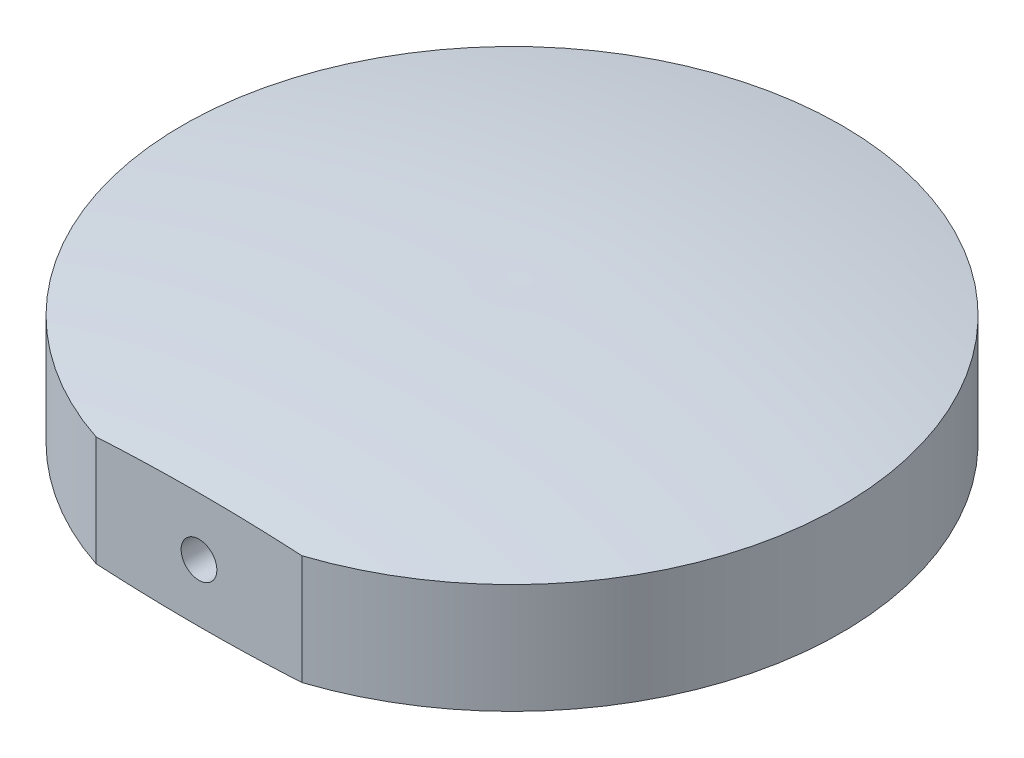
ISO-10303-21;
HEADER;
FILE_DESCRIPTION(('STEP AP214'),'2;1');
FILE_NAME('part.step','',(''),(''),'','','');
FILE_SCHEMA(('AUTOMOTIVE_DESIGN { 1 0 10303 214 1 1 1 1 }'));
ENDSEC;
DATA;
#1=APPLICATION_CONTEXT('core data for automotive mechanical design processes');
#2=APPLICATION_PROTOCOL_DEFINITION('international standard','automotive_design',2000,#1);
#3=PRODUCT_CONTEXT('',#1,'mechanical');
#4=PRODUCT('Part','Part','',(#3));
#5=PRODUCT_RELATED_PRODUCT_CATEGORY('part','',(#4));
#6=PRODUCT_DEFINITION_FORMATION('','',#4);
#7=PRODUCT_DEFINITION_CONTEXT('part definition',#1,'design');
#8=PRODUCT_DEFINITION('design','',#6,#7);
#9=PRODUCT_DEFINITION_SHAPE('','',#8);
#10=(LENGTH_UNIT() NAMED_UNIT(*) SI_UNIT(.MILLI.,.METRE.));
#11=(NAMED_UNIT(*) PLANE_ANGLE_UNIT() SI_UNIT($,.RADIAN.));
#12=(NAMED_UNIT(*) SI_UNIT($,.STERADIAN.) SOLID_ANGLE_UNIT());
#13=UNCERTAINTY_MEASURE_WITH_UNIT(LENGTH_MEASURE(1.E-05),#10,'distance_accuracy_value','');
#14=(GEOMETRIC_REPRESENTATION_CONTEXT(3) GLOBAL_UNCERTAINTY_ASSIGNED_CONTEXT((#13)) GLOBAL_UNIT_ASSIGNED_CONTEXT((#10,
#11,#12)) REPRESENTATION_CONTEXT('',''));
#15=CARTESIAN_POINT('',(0.,0.,0.));
#16=DIRECTION('',(0.,0.,1.));
#17=DIRECTION('',(1.,0.,0.));
#18=AXIS2_PLACEMENT_3D('',#15,#16,#17);
#19=CARTESIAN_POINT('',(0.,-297.99298140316,-4.12558488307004));
#20=DIRECTION('',(-1.,0.,0.));
#21=DIRECTION('',(0.,0.,-1.));
#22=AXIS2_PLACEMENT_3D('',#19,#20,#21);
#23=CIRCLE('',#22,313.020170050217);
#24=TRIMMED_CURVE('',#23,(PARAMETER_VALUE(-1.58397664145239)),
(PARAMETER_VALUE(1.58397664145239)),.T.,.PARAMETER.);
#25=CARTESIAN_POINT('',(0.,-297.99298140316,0.));
#26=DIRECTION('',(0.,-1.,0.));
#27=AXIS1_PLACEMENT('',#25,#26);
#28=SURFACE_OF_REVOLUTION('',#24,#27);
#29=CARTESIAN_POINT('',(0.,10.5291783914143,57.));
#30=CARTESIAN_POINT('',(-2.40286460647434,10.5291785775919,57.));
#31=CARTESIAN_POINT('',(-4.80574337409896,10.5031453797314,57.));
#32=CARTESIAN_POINT('',(-9.61036932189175,10.3989289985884,57.));
#33=CARTESIAN_POINT('',(-12.0121164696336,10.3207444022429,57.));
#34=CARTESIAN_POINT('',(-19.2144634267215,10.0075703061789,57.));
#35=CARTESIAN_POINT('',(-24.0120080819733,9.6939604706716,57.));
#36=CARTESIAN_POINT('',(-31.1967523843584,9.06404717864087,57.));
#37=CARTESIAN_POINT('',(-33.5912635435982,8.82729077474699,57.));
#38=CARTESIAN_POINT('',(-38.3744207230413,8.3002166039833,57.));
#39=CARTESIAN_POINT('',(-40.7630668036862,8.00989939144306,57.));
#40=CARTESIAN_POINT('',(-45.5334868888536,7.37540329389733,57.));
#41=CARTESIAN_POINT('',(-47.915260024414,7.03121787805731,57.));
#42=CARTESIAN_POINT('',(-52.6704503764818,6.28882695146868,57.));
#43=CARTESIAN_POINT('',(-55.0438672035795,5.89061895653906,57.));
#44=CARTESIAN_POINT('',(-61.7286773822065,4.69037615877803,57.));
#45=CARTESIAN_POINT('',(-66.028970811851,3.82551428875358,57.));
#46=CARTESIAN_POINT('',(-74.5897326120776,1.91613757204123,57.));
#47=CARTESIAN_POINT('',(-78.8501977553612,0.871608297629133,57.));
#48=CARTESIAN_POINT('',(-87.3246384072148,-1.39649653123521,57.));
#49=CARTESIAN_POINT('',(-91.5385993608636,-2.6201265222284,57.));
#50=CARTESIAN_POINT('',(-99.9108718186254,-5.24460526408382,57.));
#51=CARTESIAN_POINT('',(-104.069184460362,-6.64545038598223,57.));
#52=CARTESIAN_POINT('',(-112.326403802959,-9.62364947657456,57.));
#53=CARTESIAN_POINT('',(-116.425252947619,-11.2011630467,57.));
#54=CARTESIAN_POINT('',(-124.55216813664,-14.5291205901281,57.));
#55=CARTESIAN_POINT('',(-128.580233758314,-16.2795655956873,57.));
#56=CARTESIAN_POINT('',(-136.557843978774,-19.9502701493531,57.));
#57=CARTESIAN_POINT('',(-140.507394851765,-21.8705160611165,57.));
#58=CARTESIAN_POINT('',(-148.321053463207,-25.8776041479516,57.));
#59=CARTESIAN_POINT('',(-152.185161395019,-27.9644459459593,57.));
#60=CARTESIAN_POINT('',(-159.804162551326,-32.2915651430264,57.));
#61=CARTESIAN_POINT('',(-163.559459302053,-34.5311320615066,57.));
#62=CARTESIAN_POINT('',(-170.971508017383,-39.1677984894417,57.));
#63=CARTESIAN_POINT('',(-174.628260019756,-41.5648979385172,57.));
#64=CARTESIAN_POINT('',(-181.836635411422,-46.5124037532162,57.));
#65=CARTESIAN_POINT('',(-185.388256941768,-49.062812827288,57.));
#66=CARTESIAN_POINT('',(-192.379848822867,-54.3123353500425,57.));
#67=CARTESIAN_POINT('',(-195.819819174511,-57.0114487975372,57.));
#68=CARTESIAN_POINT('',(-202.581187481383,-62.5529844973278,57.));
#69=CARTESIAN_POINT('',(-205.902608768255,-65.3953782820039,57.));
#70=CARTESIAN_POINT('',(-212.421563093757,-71.2188530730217,57.));
#71=CARTESIAN_POINT('',(-215.619096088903,-74.1999341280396,57.));
#72=CARTESIAN_POINT('',(-221.884436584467,-80.2953812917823,57.));
#73=CARTESIAN_POINT('',(-224.952245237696,-83.409746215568,57.));
#74=CARTESIAN_POINT('',(-230.952593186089,-89.7661625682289,57.));
#75=CARTESIAN_POINT('',(-233.885132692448,-93.0082137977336,57.));
#76=CARTESIAN_POINT('',(-239.585812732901,-99.5866738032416,57.));
#77=CARTESIAN_POINT('',(-242.355117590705,-102.922073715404,57.));
#78=CARTESIAN_POINT('',(-247.750517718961,-109.706753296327,57.));
#79=CARTESIAN_POINT('',(-250.376613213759,-113.156032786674,57.));
#80=CARTESIAN_POINT('',(-255.48089629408,-120.162322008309,57.));
#81=CARTESIAN_POINT('',(-257.959084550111,-123.719331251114,57.));
#82=CARTESIAN_POINT('',(-262.763142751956,-130.93476620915,57.));
#83=CARTESIAN_POINT('',(-265.08901263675,-134.593191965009,57.));
#84=CARTESIAN_POINT('',(-269.584271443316,-142.004930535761,57.));
#85=CARTESIAN_POINT('',(-271.753660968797,-145.758242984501,57.));
#86=CARTESIAN_POINT('',(-275.932095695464,-153.353084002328,57.));
#87=CARTESIAN_POINT('',(-277.941140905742,-157.194612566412,57.));
#88=CARTESIAN_POINT('',(-281.79530182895,-164.95904594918,57.));
#89=CARTESIAN_POINT('',(-283.640417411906,-168.881950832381,57.));
#90=CARTESIAN_POINT('',(-287.163423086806,-176.802144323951,57.));
#91=CARTESIAN_POINT('',(-288.841313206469,-180.79943291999,57.));
#92=CARTESIAN_POINT('',(-292.025215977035,-188.857078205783,57.));
#93=CARTESIAN_POINT('',(-293.531405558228,-192.91736498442,57.));
#94=CARTESIAN_POINT('',(-296.371234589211,-201.097838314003,57.));
#95=CARTESIAN_POINT('',(-297.704874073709,-205.218024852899,57.));
#96=CARTESIAN_POINT('',(-300.197226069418,-213.510965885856,57.));
#97=CARTESIAN_POINT('',(-301.355938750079,-217.683720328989,57.));
#98=CARTESIAN_POINT('',(-303.496374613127,-226.074379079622,57.));
#99=CARTESIAN_POINT('',(-304.478097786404,-230.292283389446,57.));
#100=CARTESIAN_POINT('',(-306.26281257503,-238.76577119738,57.));
#101=CARTESIAN_POINT('',(-307.065802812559,-243.021354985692,57.));
#102=CARTESIAN_POINT('',(-308.491611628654,-251.562599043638,57.));
#103=CARTESIAN_POINT('',(-309.114430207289,-255.84825931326,57.));
#104=CARTESIAN_POINT('',(-310.178786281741,-264.442032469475,57.));
#105=CARTESIAN_POINT('',(-310.620323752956,-268.750145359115,57.));
#106=CARTESIAN_POINT('',(-311.321330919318,-277.381158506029,57.));
#107=CARTESIAN_POINT('',(-311.580800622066,-281.704058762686,57.));
#108=CARTESIAN_POINT('',(-311.917169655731,-290.355916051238,57.));
#109=CARTESIAN_POINT('',(-311.994112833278,-294.684871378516,57.));
#110=CARTESIAN_POINT('',(-311.965419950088,-303.342176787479,57.));
#111=CARTESIAN_POINT('',(-311.859783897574,-307.67052686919,57.));
#112=CARTESIAN_POINT('',(-311.466120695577,-316.318923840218,57.));
#113=CARTESIAN_POINT('',(-311.178093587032,-320.638970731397,57.));
#114=CARTESIAN_POINT('',(-310.420161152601,-329.263080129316,57.));
#115=CARTESIAN_POINT('',(-309.950255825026,-333.567142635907,57.));
#116=CARTESIAN_POINT('',(-308.829410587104,-342.151576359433,57.));
#117=CARTESIAN_POINT('',(-308.17847291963,-346.431947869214,57.));
#118=CARTESIAN_POINT('',(-306.696719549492,-354.961442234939,57.));
#119=CARTESIAN_POINT('',(-305.865903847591,-359.210565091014,57.));
#120=CARTESIAN_POINT('',(-304.025873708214,-367.67000684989,57.));
#121=CARTESIAN_POINT('',(-303.016659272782,-371.880325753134,57.));
#122=CARTESIAN_POINT('',(-300.821628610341,-380.254673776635,57.));
#123=CARTESIAN_POINT('',(-299.635812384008,-384.418702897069,57.));
#124=CARTESIAN_POINT('',(-297.089726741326,-392.692947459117,57.));
#125=CARTESIAN_POINT('',(-295.729462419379,-396.803164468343,57.));
#126=CARTESIAN_POINT('',(-292.836875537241,-404.962602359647,57.));
#127=CARTESIAN_POINT('',(-291.304552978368,-409.011823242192,57.));
#128=CARTESIAN_POINT('',(-288.070577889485,-417.042071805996,57.));
#129=CARTESIAN_POINT('',(-286.368925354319,-421.023099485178,57.));
#130=CARTESIAN_POINT('',(-282.799320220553,-428.909886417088,57.));
#131=CARTESIAN_POINT('',(-280.93136762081,-432.815645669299,57.));
#132=CARTESIAN_POINT('',(-277.032448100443,-440.545035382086,57.));
#133=CARTESIAN_POINT('',(-275.001477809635,-444.368664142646,57.));
#134=CARTESIAN_POINT('',(-270.780173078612,-451.926916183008,57.));
#135=CARTESIAN_POINT('',(-268.589838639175,-455.661539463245,57.));
#136=CARTESIAN_POINT('',(-264.053706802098,-463.035145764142,57.));
#137=CARTESIAN_POINT('',(-261.707909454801,-466.674128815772,57.));
#138=CARTESIAN_POINT('',(-256.865028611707,-473.849994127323,57.));
#139=CARTESIAN_POINT('',(-254.36794511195,-477.386876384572,57.));
#140=CARTESIAN_POINT('',(-249.226550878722,-484.352787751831,57.));
#141=CARTESIAN_POINT('',(-246.582217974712,-487.781800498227,57.));
#142=CARTESIAN_POINT('',(-241.151379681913,-494.52532849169,57.));
#143=CARTESIAN_POINT('',(-238.364874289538,-497.839843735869,57.));
#144=CARTESIAN_POINT('',(-232.654652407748,-504.348501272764,57.));
#145=CARTESIAN_POINT('',(-229.730935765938,-507.54264343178,57.));
#146=CARTESIAN_POINT('',(-223.751503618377,-513.804889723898,57.));
#147=CARTESIAN_POINT('',(-220.695788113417,-516.872993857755,57.));
#148=CARTESIAN_POINT('',(-214.457871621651,-522.877665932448,57.));
#149=CARTESIAN_POINT('',(-211.27567341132,-525.81423675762,57.));
#150=CARTESIAN_POINT('',(-204.79039935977,-531.550721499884,57.));
#151=CARTESIAN_POINT('',(-201.487323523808,-534.350635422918,57.));
#152=CARTESIAN_POINT('',(-194.766194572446,-539.808853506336,57.));
#153=CARTESIAN_POINT('',(-191.348141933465,-542.467158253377,57.));
#154=CARTESIAN_POINT('',(-184.403138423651,-547.637490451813,57.));
#155=CARTESIAN_POINT('',(-180.876187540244,-550.14951788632,57.));
#156=CARTESIAN_POINT('',(-173.717227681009,-555.024554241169,57.));
#157=CARTESIAN_POINT('',(-170.085148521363,-557.38746009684,57.));
#158=CARTESIAN_POINT('',(-162.724723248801,-561.958249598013,57.));
#159=CARTESIAN_POINT('',(-158.996377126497,-564.166133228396,57.));
#160=CARTESIAN_POINT('',(-151.450035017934,-568.423068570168,57.));
#161=CARTESIAN_POINT('',(-147.632038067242,-570.472118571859,57.));
#162=CARTESIAN_POINT('',(-139.913252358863,-574.407841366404,57.));
#163=CARTESIAN_POINT('',(-136.012463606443,-576.294514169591,57.));
#164=CARTESIAN_POINT('',(-128.135694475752,-579.902006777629,57.));
#165=CARTESIAN_POINT('',(-124.159726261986,-581.622853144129,57.));
#166=CARTESIAN_POINT('',(-116.139093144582,-584.896206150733,57.));
#167=CARTESIAN_POINT('',(-112.094428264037,-586.448712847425,57.));
#168=CARTESIAN_POINT('',(-103.943773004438,-589.382893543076,57.));
#169=CARTESIAN_POINT('',(-99.8377848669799,-590.764573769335,57.));
#170=CARTESIAN_POINT('',(-91.5716690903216,-593.355162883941,57.));
#171=CARTESIAN_POINT('',(-87.4115414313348,-594.564071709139,57.));
#172=CARTESIAN_POINT('',(-79.0323795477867,-596.81088283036,57.));
#173=CARTESIAN_POINT('',(-74.8132090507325,-597.848276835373,57.));
#174=CARTESIAN_POINT('',(-66.3354268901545,-599.746863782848,57.));
#175=CARTESIAN_POINT('',(-62.0768152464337,-600.608056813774,57.));
#176=CARTESIAN_POINT('',(-53.527582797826,-602.154099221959,57.));
#177=CARTESIAN_POINT('',(-49.2369609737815,-602.838942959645,57.));
#178=CARTESIAN_POINT('',(-40.6313722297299,-604.032965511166,57.));
#179=CARTESIAN_POINT('',(-36.3164052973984,-604.542144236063,57.));
#180=CARTESIAN_POINT('',(-27.666987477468,-605.386709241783,57.));
#181=CARTESIAN_POINT('',(-23.3325266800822,-605.721993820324,57.));
#182=CARTESIAN_POINT('',(-14.6537338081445,-606.220483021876,57.));
#183=CARTESIAN_POINT('',(-10.3094016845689,-606.383686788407,57.));
#184=CARTESIAN_POINT('',(-1.61743415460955,-606.539639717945,57.));
#185=CARTESIAN_POINT('',(2.73020143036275,-606.532378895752,57.));
#186=CARTESIAN_POINT('',(11.4218622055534,-606.347296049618,57.));
#187=CARTESIAN_POINT('',(15.7658873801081,-606.16947328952,57.));
#188=CARTESIAN_POINT('',(24.6421054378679,-605.629454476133,57.));
#189=CARTESIAN_POINT('',(29.1738114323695,-605.259192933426,57.));
#190=CARTESIAN_POINT('',(38.2176101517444,-604.327796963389,57.));
#191=CARTESIAN_POINT('',(42.7297028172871,-603.76666195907,57.));
#192=CARTESIAN_POINT('',(51.72552600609,-602.451838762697,57.));
#193=CARTESIAN_POINT('',(56.2092580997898,-601.698161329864,57.));
#194=CARTESIAN_POINT('',(65.1399613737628,-599.997634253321,57.));
#195=CARTESIAN_POINT('',(69.5869325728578,-599.050784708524,57.));
#196=CARTESIAN_POINT('',(78.4326388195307,-596.964993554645,57.));
#197=CARTESIAN_POINT('',(82.8314026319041,-595.826173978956,57.));
#198=CARTESIAN_POINT('',(91.5749480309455,-593.35728165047,57.));
#199=CARTESIAN_POINT('',(95.9197295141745,-592.027208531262,57.));
#200=CARTESIAN_POINT('',(104.546919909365,-589.177705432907,57.));
#201=CARTESIAN_POINT('',(108.829326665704,-587.658268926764,57.));
#202=CARTESIAN_POINT('',(117.323191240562,-584.432595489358,57.));
#203=CARTESIAN_POINT('',(121.534649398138,-582.726359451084,57.));
#204=CARTESIAN_POINT('',(129.777179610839,-579.173712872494,57.));
#205=CARTESIAN_POINT('',(133.810149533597,-577.331703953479,57.));
#206=CARTESIAN_POINT('',(141.793120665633,-573.475931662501,57.));
#207=CARTESIAN_POINT('',(145.743122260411,-571.462169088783,57.));
#208=CARTESIAN_POINT('',(153.55267955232,-567.266533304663,57.));
#209=CARTESIAN_POINT('',(157.412237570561,-565.084664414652,57.));
#210=CARTESIAN_POINT('',(165.033803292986,-560.556714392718,57.));
#211=CARTESIAN_POINT('',(168.795810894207,-558.210633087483,57.));
#212=CARTESIAN_POINT('',(176.216332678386,-553.357826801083,57.));
#213=CARTESIAN_POINT('',(179.87481602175,-550.851054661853,57.));
#214=CARTESIAN_POINT('',(187.080295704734,-545.682090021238,57.));
#215=CARTESIAN_POINT('',(190.627291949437,-543.019897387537,57.));
#216=CARTESIAN_POINT('',(197.603144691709,-537.545018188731,57.));
#217=CARTESIAN_POINT('',(201.032001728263,-534.732332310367,57.));
#218=CARTESIAN_POINT('',(207.765175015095,-528.961664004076,57.));
#219=CARTESIAN_POINT('',(211.069491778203,-526.003682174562,57.));
#220=CARTESIAN_POINT('',(217.4779881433,-520.012806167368,57.));
#221=CARTESIAN_POINT('',(220.584939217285,-516.98287587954,57.));
#222=CARTESIAN_POINT('',(226.668109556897,-510.794520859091,57.));
#223=CARTESIAN_POINT('',(229.644329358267,-507.636096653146,57.));
#224=CARTESIAN_POINT('',(235.460669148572,-501.19642231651,57.));
#225=CARTESIAN_POINT('',(238.300791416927,-497.915174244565,57.));
#226=CARTESIAN_POINT('',(243.839911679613,-491.235641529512,57.));
#227=CARTESIAN_POINT('',(246.538909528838,-487.83735676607,57.));
#228=CARTESIAN_POINT('',(251.790490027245,-480.930412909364,57.));
#229=CARTESIAN_POINT('',(254.343098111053,-477.421773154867,57.));
#230=CARTESIAN_POINT('',(259.297841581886,-470.299810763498,57.));
#231=CARTESIAN_POINT('',(261.699977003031,-466.686488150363,57.));
#232=CARTESIAN_POINT('',(266.349487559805,-459.361589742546,57.));
#233=CARTESIAN_POINT('',(268.596862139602,-455.650013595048,57.));
#234=CARTESIAN_POINT('',(272.932821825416,-448.135241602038,57.));
#235=CARTESIAN_POINT('',(275.021406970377,-444.332045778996,57.));
#236=CARTESIAN_POINT('',(279.032527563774,-436.647573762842,57.));
#237=CARTESIAN_POINT('',(280.955348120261,-432.766446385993,57.));
#238=CARTESIAN_POINT('',(284.635608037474,-424.926558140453,57.));
#239=CARTESIAN_POINT('',(286.393047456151,-420.967797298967,57.));
#240=CARTESIAN_POINT('',(289.739410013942,-412.979691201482,57.));
#241=CARTESIAN_POINT('',(291.328333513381,-408.95034609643,57.));
#242=CARTESIAN_POINT('',(294.334837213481,-400.828230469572,57.));
#243=CARTESIAN_POINT('',(295.752417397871,-396.735459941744,57.));
#244=CARTESIAN_POINT('',(298.413765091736,-388.493598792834,57.));
#245=CARTESIAN_POINT('',(299.657525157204,-384.344505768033,57.));
#246=CARTESIAN_POINT('',(301.968944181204,-375.997554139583,57.));
#247=CARTESIAN_POINT('',(303.03660313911,-371.79969553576,57.));
#248=CARTESIAN_POINT('',(304.993917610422,-363.362681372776,57.));
#249=CARTESIAN_POINT('',(305.88357305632,-359.123525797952,57.));
#250=CARTESIAN_POINT('',(307.483294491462,-350.611463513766,57.));
#251=CARTESIAN_POINT('',(308.193360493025,-346.338556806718,57.));
#252=CARTESIAN_POINT('',(309.43239645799,-337.768265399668,57.));
#253=CARTESIAN_POINT('',(309.961436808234,-333.470890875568,57.));
#254=CARTESIAN_POINT('',(310.837861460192,-324.857657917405,57.));
#255=CARTESIAN_POINT('',(311.185245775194,-320.541799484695,57.));
#256=CARTESIAN_POINT('',(311.697739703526,-311.899275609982,57.));
#257=CARTESIAN_POINT('',(311.862849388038,-307.5726101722,57.));
#258=CARTESIAN_POINT('',(312.010500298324,-298.916165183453,57.));
#259=CARTESIAN_POINT('',(311.993041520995,-294.586385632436,57.));
#260=CARTESIAN_POINT('',(311.775587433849,-285.931446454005,57.));
#261=CARTESIAN_POINT('',(311.575593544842,-281.606286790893,57.));
#262=CARTESIAN_POINT('',(310.993427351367,-272.968245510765,57.));
#263=CARTESIAN_POINT('',(310.611255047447,-268.655363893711,57.));
#264=CARTESIAN_POINT('',(309.665412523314,-260.049548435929,57.));
#265=CARTESIAN_POINT('',(309.101742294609,-255.756614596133,57.));
#266=CARTESIAN_POINT('',(307.793907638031,-247.198329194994,57.));
#267=CARTESIAN_POINT('',(307.049743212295,-242.932977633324,57.));
#268=CARTESIAN_POINT('',(305.382305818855,-234.437750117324,57.));
#269=CARTESIAN_POINT('',(304.459045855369,-230.207871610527,57.));
#270=CARTESIAN_POINT('',(302.435026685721,-221.790797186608,57.));
#271=CARTESIAN_POINT('',(301.334267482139,-217.603601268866,57.));
#272=CARTESIAN_POINT('',(298.9572097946,-209.279336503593,57.));
#273=CARTESIAN_POINT('',(297.680911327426,-205.142267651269,57.));
#274=CARTESIAN_POINT('',(294.955047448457,-196.925611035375,57.));
#275=CARTESIAN_POINT('',(293.505482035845,-192.846023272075,57.));
#276=CARTESIAN_POINT('',(290.435665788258,-184.751581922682,57.));
#277=CARTESIAN_POINT('',(288.815415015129,-180.736728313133,57.));
#278=CARTESIAN_POINT('',(285.407112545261,-172.778889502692,57.));
#279=CARTESIAN_POINT('',(283.61906084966,-168.835904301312,57.));
#280=CARTESIAN_POINT('',(279.878340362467,-161.028809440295,57.));
#281=CARTESIAN_POINT('',(277.925671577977,-157.164699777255,57.));
#282=CARTESIAN_POINT('',(273.859193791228,-149.522221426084,57.));
#283=CARTESIAN_POINT('',(271.745384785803,-145.743852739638,57.));
#284=CARTESIAN_POINT('',(267.360149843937,-138.279158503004,57.));
#285=CARTESIAN_POINT('',(265.08870663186,-134.592843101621,57.));
#286=CARTESIAN_POINT('',(260.392455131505,-127.319233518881,57.));
#287=CARTESIAN_POINT('',(257.96764684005,-123.731939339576,57.));
#288=CARTESIAN_POINT('',(252.968983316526,-116.662740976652,57.));
#289=CARTESIAN_POINT('',(250.395128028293,-113.180836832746,57.));
#290=CARTESIAN_POINT('',(245.102956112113,-106.328600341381,57.));
#291=CARTESIAN_POINT('',(242.384639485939,-102.958267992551,57.));
#292=CARTESIAN_POINT('',(236.808514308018,-96.3353051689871,57.));
#293=CARTESIAN_POINT('',(233.950712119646,-93.0826693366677,57.));
#294=CARTESIAN_POINT('',(228.100592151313,-86.7007038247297,57.));
#295=CARTESIAN_POINT('',(225.108274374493,-83.5713741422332,57.));
#296=CARTESIAN_POINT('',(218.994460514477,-77.4415699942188,57.));
#297=CARTESIAN_POINT('',(215.872964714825,-74.4410952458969,57.));
#298=CARTESIAN_POINT('',(209.506349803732,-68.5743015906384,57.));
#299=CARTESIAN_POINT('',(206.261230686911,-65.7079826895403,57.));
#300=CARTESIAN_POINT('',(199.652349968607,-60.113885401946,57.));
#301=CARTESIAN_POINT('',(196.288559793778,-57.3861407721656,57.));
#302=CARTESIAN_POINT('',(189.449078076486,-52.0747479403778,57.));
#303=CARTESIAN_POINT('',(185.973386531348,-49.4910997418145,57.));
#304=CARTESIAN_POINT('',(178.916271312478,-44.4724225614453,57.));
#305=CARTESIAN_POINT('',(175.334846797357,-42.0373947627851,57.));
#306=CARTESIAN_POINT('',(168.072679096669,-37.3202446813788,57.));
#307=CARTESIAN_POINT('',(164.391935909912,-35.0381224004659,57.));
#308=CARTESIAN_POINT('',(156.936409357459,-30.6299950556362,57.));
#309=CARTESIAN_POINT('',(153.161593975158,-28.5040441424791,57.));
#310=CARTESIAN_POINT('',(145.525884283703,-24.4127991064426,57.));
#311=CARTESIAN_POINT('',(141.664989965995,-22.4475049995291,57.));
#312=CARTESIAN_POINT('',(133.864151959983,-18.6809871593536,57.));
#313=CARTESIAN_POINT('',(129.924211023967,-16.8797577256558,57.));
#314=CARTESIAN_POINT('',(121.972188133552,-13.4442975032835,57.));
#315=CARTESIAN_POINT('',(117.960106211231,-11.810066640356,57.));
#316=CARTESIAN_POINT('',(109.86085720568,-8.7073633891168,57.));
#317=CARTESIAN_POINT('',(105.773527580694,-7.23931530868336,57.));
#318=CARTESIAN_POINT('',(97.5408877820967,-4.47593259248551,57.));
#319=CARTESIAN_POINT('',(93.3955774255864,-3.18059850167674,57.));
#320=CARTESIAN_POINT('',(85.053895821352,-0.764263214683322,57.));
#321=CARTESIAN_POINT('',(80.8575181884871,0.356715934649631,57.));
#322=CARTESIAN_POINT('',(72.4217777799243,2.42291990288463,57.));
#323=CARTESIAN_POINT('',(68.182415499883,3.36814674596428,57.));
#324=CARTESIAN_POINT('',(59.6764836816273,5.08065813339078,57.));
#325=CARTESIAN_POINT('',(55.4099828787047,5.84828432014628,57.));
#326=CARTESIAN_POINT('',(46.8489787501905,7.20824274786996,57.));
#327=CARTESIAN_POINT('',(42.554474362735,7.80056830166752,57.));
#328=CARTESIAN_POINT('',(33.9474169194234,8.81080170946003,57.));
#329=CARTESIAN_POINT('',(29.6348747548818,9.22880275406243,57.));
#330=CARTESIAN_POINT('',(20.996670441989,9.89281858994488,57.));
#331=CARTESIAN_POINT('',(16.6710090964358,10.1388436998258,57.));
#332=CARTESIAN_POINT('',(11.3142829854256,10.3381275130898,57.));
#333=CARTESIAN_POINT('',(10.2858461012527,10.3715852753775,57.));
#334=CARTESIAN_POINT('',(8.22879169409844,10.4289221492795,57.));
#335=CARTESIAN_POINT('',(7.20017419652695,10.4528021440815,57.));
#336=CARTESIAN_POINT('',(4.11455977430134,10.5100944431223,57.));
#337=CARTESIAN_POINT('',(2.05728507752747,10.5291782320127,57.));
#338=CARTESIAN_POINT('',(0.,10.5291783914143,57.));
#339=B_SPLINE_CURVE_WITH_KNOTS('',3,(#29,#30,#31,#32,#33,#34,#35,#36,#37,#38,#39,#40,#41,#42,
#43,#44,#45,#46,#47,#48,#49,#50,#51,#52,#53,#54,#55,#56,#57,#58,#59,#60,#61,#62,#63,#64,#65,#66,
#67,#68,#69,#70,#71,#72,#73,#74,#75,#76,#77,#78,#79,#80,#81,#82,#83,#84,#85,#86,#87,#88,#89,#90,
#91,#92,#93,#94,#95,#96,#97,#98,#99,#100,#101,#102,#103,#104,#105,#106,#107,#108,#109,#110,#111,
#112,#113,#114,#115,#116,#117,#118,#119,#120,#121,#122,#123,#124,#125,#126,#127,#128,#129,#130,
#131,#132,#133,#134,#135,#136,#137,#138,#139,#140,#141,#142,#143,#144,#145,#146,#147,#148,#149,
#150,#151,#152,#153,#154,#155,#156,#157,#158,#159,#160,#161,#162,#163,#164,#165,#166,#167,#168,
#169,#170,#171,#172,#173,#174,#175,#176,#177,#178,#179,#180,#181,#182,#183,#184,#185,#186,#187,
#188,#189,#190,#191,#192,#193,#194,#195,#196,#197,#198,#199,#200,#201,#202,#203,#204,#205,#206,
#207,#208,#209,#210,#211,#212,#213,#214,#215,#216,#217,#218,#219,#220,#221,#222,#223,#224,#225,
#226,#227,#228,#229,#230,#231,#232,#233,#234,#235,#236,#237,#238,#239,#240,#241,#242,#243,#244,
#245,#246,#247,#248,#249,#250,#251,#252,#253,#254,#255,#256,#257,#258,#259,#260,#261,#262,#263,
#264,#265,#266,#267,#268,#269,#270,#271,#272,#273,#274,#275,#276,#277,#278,#279,#280,#281,#282,
#283,#284,#285,#286,#287,#288,#289,#290,#291,#292,#293,#294,#295,#296,#297,#298,#299,#300,#301,
#302,#303,#304,#305,#306,#307,#308,#309,#310,#311,#312,#313,#314,#315,#316,#317,#318,#319,#320,
#321,#322,#323,#324,#325,#326,#327,#328,#329,#330,#331,#332,#333,#334,#335,#336,#337,#338),
.UNSPECIFIED.,.T.,.F.,(4,2,2,2,2,2,2,2,2,2,2,2,2,2,2,2,2,2,2,2,2,2,2,2,2,2,2,2,2,2,2,2,2,2,2,2,
2,2,2,2,2,2,2,2,2,2,2,2,2,2,2,2,2,2,2,2,2,2,2,2,2,2,2,2,2,2,2,2,2,2,2,2,2,2,2,2,2,2,2,2,2,2,2,2,
2,2,2,2,2,2,2,2,2,2,2,2,2,2,2,2,2,2,2,2,2,2,2,2,2,2,2,2,2,2,2,2,2,2,2,2,2,2,2,2,2,2,2,2,2,2,2,2,
2,2,2,2,2,2,2,2,2,2,2,2,2,2,2,2,2,2,2,2,2,2,4),(0.,7.20844734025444,14.4170900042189,
28.8348569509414,36.052963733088,43.2709958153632,50.4899036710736,57.7091435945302,
70.8642041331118,84.0203215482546,97.1804460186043,110.340301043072,123.512142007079,
136.684061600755,149.854924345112,163.025757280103,176.139024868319,189.252287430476,
202.365781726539,215.479275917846,228.590174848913,241.701078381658,254.811865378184,
267.922631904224,280.924371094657,293.926089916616,306.927749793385,319.929414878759,
332.931029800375,345.932643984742,358.934268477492,371.935890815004,384.923992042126,
397.912090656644,410.900176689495,423.888263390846,436.876450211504,449.864637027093,
462.852825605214,475.841013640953,488.826081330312,501.811148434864,514.796212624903,
527.781276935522,540.76618037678,553.751083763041,566.735987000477,579.720890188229,
592.705414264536,605.689938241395,618.67446261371,631.658987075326,644.643780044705,
657.628572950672,670.613361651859,683.598150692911,696.584900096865,709.57164982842,
722.558413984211,735.545178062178,748.531657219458,761.518135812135,774.504560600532,
787.490986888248,800.48629254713,813.481599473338,826.477046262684,839.472492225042,
852.465853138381,865.459209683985,878.452092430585,891.44497992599,904.475707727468,
917.506428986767,930.537566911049,943.568711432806,956.607468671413,969.646290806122,
982.685876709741,995.725518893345,1009.36192681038,1022.99837594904,1036.63406325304,
1050.26974357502,1063.89678829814,1077.52385912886,1091.15139978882,1104.77887530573,
1118.0759446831,1131.37295226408,1144.66961822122,1157.96629821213,1171.2668984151,
1184.56750994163,1197.86806077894,1211.16855684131,1224.18401798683,1237.19942578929,
1250.2146155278,1263.22981864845,1276.24275353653,1289.25568547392,1302.26866414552,
1315.28163962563,1328.27176718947,1341.26189020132,1354.25198543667,1367.24208190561,
1380.2327345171,1393.22338717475,1406.21404475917,1419.20470145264,1432.19030133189,
1445.17590026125,1458.16149411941,1471.14708819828,1484.13258120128,1497.11807416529,
1510.10356773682,1523.08906115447,1536.07361204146,1549.0581627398,1562.04271219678,
1575.02726171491,1588.01180652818,1600.99635125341,1613.98089541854,1626.9654398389,
1639.95140953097,1652.93737949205,1665.92335434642,1678.90932904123,1691.89471186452,
1704.88009438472,1717.86544840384,1730.85080298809,1743.83930578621,1756.82780889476,
1769.81641538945,1782.80502203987,1795.79811129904,1808.79120184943,1821.78384078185,
1834.77647393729,1847.80156609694,1860.82669935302,1873.85347827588,1886.88010715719,
1899.88146499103,1912.88331872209,1925.87821296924,1938.87232745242,1941.9592512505,
1945.04589033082,1951.21762015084),.UNSPECIFIED.);
#340=CARTESIAN_POINT('',(18.7349939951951,10.,57.));
#341=VERTEX_POINT('',#340);
#342=CARTESIAN_POINT('',(-18.7349939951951,10.,57.));
#343=VERTEX_POINT('',#342);
#344=EDGE_CURVE('E73',#341,#343,#339,.T.);
#345=ORIENTED_EDGE('',*,*,#344,.F.);
#346=CARTESIAN_POINT('',(0.,10.,0.));
#347=DIRECTION('',(0.,-1.,0.));
#348=DIRECTION('',(0.,0.,-1.));
#349=AXIS2_PLACEMENT_3D('',#346,#347,#348);
#350=CIRCLE('',#349,60.);
#351=EDGE_CURVE('E11',#343,#341,#350,.T.);
#352=ORIENTED_EDGE('',*,*,#351,.F.);
#353=EDGE_LOOP('',(#345,#352));
#354=FACE_BOUND('',#353,.T.);
#355=CARTESIAN_POINT('',(0.,15.,0.));
#356=VERTEX_POINT('',#355);
#357=VERTEX_LOOP('',#356);
#358=FACE_BOUND('',#357,.T.);
#359=ADVANCED_FACE('F33',(#354,#358),#28,.T.);
#360=CARTESIAN_POINT('',(0.,-15.,0.));
#361=DIRECTION('',(0.,-1.,0.));
#362=DIRECTION('',(0.,0.,-1.));
#363=AXIS2_PLACEMENT_3D('',#360,#361,#362);
#364=CYLINDRICAL_SURFACE('',#363,59.9999999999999);
#365=DIRECTION('',(0.,1.,0.));
#366=VECTOR('',#365,1.);
#367=CARTESIAN_POINT('',(18.7349939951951,-76.5,57.));
#368=LINE('',#367,#366);
#369=CARTESIAN_POINT('',(18.7349939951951,-10.0000000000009,57.));
#370=VERTEX_POINT('',#369);
#371=EDGE_CURVE('E68',#370,#341,#368,.T.);
#372=ORIENTED_EDGE('',*,*,#371,.F.);
#373=CARTESIAN_POINT('',(0.,-10.,0.));
#374=DIRECTION('',(0.,-1.,0.));
#375=DIRECTION('',(0.,0.,-1.));
#376=AXIS2_PLACEMENT_3D('',#373,#374,#375);
#377=CIRCLE('',#376,59.9999999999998);
#378=CARTESIAN_POINT('',(-18.7349939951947,-10.,57.));
#379=VERTEX_POINT('',#378);
#380=EDGE_CURVE('E42',#379,#370,#377,.T.);
#381=ORIENTED_EDGE('',*,*,#380,.F.);
#382=DIRECTION('',(0.,1.,0.));
#383=VECTOR('',#382,1.);
#384=CARTESIAN_POINT('',(-18.7349939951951,-76.5,57.));
#385=LINE('',#384,#383);
#386=EDGE_CURVE('E50',#379,#343,#385,.T.);
#387=ORIENTED_EDGE('',*,*,#386,.T.);
#388=ORIENTED_EDGE('',*,*,#351,.T.);
#389=EDGE_LOOP('',(#372,#381,#387,#388));
#390=FACE_BOUND('',#389,.T.);
#391=CARTESIAN_POINT('',(0.,3.25,-59.9999999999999));
#392=CARTESIAN_POINT('',(0.182410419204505,3.24999195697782,-59.9999988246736));
#393=CARTESIAN_POINT('',(0.364949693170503,3.2345913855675,-59.999159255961));
#394=CARTESIAN_POINT('',(0.724991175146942,3.17337467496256,-59.9958907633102));
#395=CARTESIAN_POINT('',(0.902487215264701,3.12752283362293,-59.9934599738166));
#396=CARTESIAN_POINT('',(1.24717467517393,3.00672151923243,-59.9872841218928));
#397=CARTESIAN_POINT('',(1.41437135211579,2.9317870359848,-59.9835397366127));
#398=CARTESIAN_POINT('',(1.73376829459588,2.7549709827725,-59.9751582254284));
#399=CARTESIAN_POINT('',(1.88597205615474,2.65309571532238,-59.9705213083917));
#400=CARTESIAN_POINT('',(2.17128414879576,2.42515911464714,-59.960870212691));
#401=CARTESIAN_POINT('',(2.3043728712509,2.29907325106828,-59.9558556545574));
#402=CARTESIAN_POINT('',(2.54750966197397,2.02634417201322,-59.9460177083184));
#403=CARTESIAN_POINT('',(2.65755678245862,1.87970011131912,-59.9411943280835));
#404=CARTESIAN_POINT('',(2.85154308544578,1.56991126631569,-59.9322798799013));
#405=CARTESIAN_POINT('',(2.93546657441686,1.40675664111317,-59.9281892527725));
#406=CARTESIAN_POINT('',(3.07472276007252,1.06864719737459,-59.9212063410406));
#407=CARTESIAN_POINT('',(3.13005570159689,0.89369247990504,-59.9183140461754));
#408=CARTESIAN_POINT('',(3.21050726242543,0.537132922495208,-59.9140574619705));
#409=CARTESIAN_POINT('',(3.23565576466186,0.355534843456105,-59.9126916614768));
#410=CARTESIAN_POINT('',(3.25511678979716,-0.00930999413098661,-59.9116375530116));
#411=CARTESIAN_POINT('',(3.2494295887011,-0.192556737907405,-59.9119492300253));
#412=CARTESIAN_POINT('',(3.20740550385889,-0.555293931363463,-59.9142135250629));
#413=CARTESIAN_POINT('',(3.17110092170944,-0.734788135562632,-59.9161644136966));
#414=CARTESIAN_POINT('',(3.0689227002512,-1.0851308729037,-59.9214845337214));
#415=CARTESIAN_POINT('',(3.00304891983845,-1.255979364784,-59.9248537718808));
#416=CARTESIAN_POINT('',(2.84356539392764,-1.58428489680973,-59.9326328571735));
#417=CARTESIAN_POINT('',(2.74994094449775,-1.7417347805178,-59.9370432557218));
#418=CARTESIAN_POINT('',(2.53762442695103,-2.03869541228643,-59.946407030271));
#419=CARTESIAN_POINT('',(2.41893214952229,-2.17820601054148,-59.9513604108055));
#420=CARTESIAN_POINT('',(2.15966704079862,-2.43551586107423,-59.9612595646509));
#421=CARTESIAN_POINT('',(2.01906624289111,-2.55328693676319,-59.9662053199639));
#422=CARTESIAN_POINT('',(1.72007344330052,-2.76355746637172,-59.97552567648));
#423=CARTESIAN_POINT('',(1.56168143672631,-2.85605691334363,-59.9799002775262));
#424=CARTESIAN_POINT('',(1.2315857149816,-3.0131558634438,-59.9875855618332));
#425=CARTESIAN_POINT('',(1.05988151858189,-3.07775435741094,-59.9908962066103));
#426=CARTESIAN_POINT('',(0.708042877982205,-3.17719914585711,-59.9960799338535));
#427=CARTESIAN_POINT('',(0.527908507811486,-3.21204570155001,-59.9979530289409));
#428=CARTESIAN_POINT('',(0.164567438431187,-3.25096266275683,-60.0000489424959));
#429=CARTESIAN_POINT('',(-0.0186350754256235,-3.25507203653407,-60.0002738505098));
#430=CARTESIAN_POINT('',(-0.383126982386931,-3.23249971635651,-59.9990535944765));
#431=CARTESIAN_POINT('',(-0.564416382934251,-3.20581814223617,-59.997608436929));
#432=CARTESIAN_POINT('',(-0.919826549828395,-3.12245357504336,-59.9932121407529));
#433=CARTESIAN_POINT('',(-1.09395150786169,-3.06578840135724,-59.9902618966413));
#434=CARTESIAN_POINT('',(-1.43021922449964,-2.92408322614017,-59.9831875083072));
#435=CARTESIAN_POINT('',(-1.59236190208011,-2.83904303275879,-59.9790633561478));
#436=CARTESIAN_POINT('',(-1.90024120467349,-2.64290220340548,-59.9700997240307));
#437=CARTESIAN_POINT('',(-2.04596118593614,-2.53177547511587,-59.9652595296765));
#438=CARTESIAN_POINT('',(-2.31669123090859,-2.28665413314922,-59.9554111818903));
#439=CARTESIAN_POINT('',(-2.44170113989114,-2.15265934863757,-59.9504030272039));
#440=CARTESIAN_POINT('',(-2.66759391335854,-1.86543772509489,-59.9407772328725));
#441=CARTESIAN_POINT('',(-2.76845154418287,-1.71219102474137,-59.9361600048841));
#442=CARTESIAN_POINT('',(-2.94300427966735,-1.39091586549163,-59.927843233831));
#443=CARTESIAN_POINT('',(-3.01669951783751,-1.22288747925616,-59.9241436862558));
#444=CARTESIAN_POINT('',(-3.13479162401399,-0.876911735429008,-59.9180824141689));
#445=CARTESIAN_POINT('',(-3.17920451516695,-0.698969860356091,-59.915719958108));
#446=CARTESIAN_POINT('',(-3.2375235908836,-0.338141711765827,-59.9125972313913));
#447=CARTESIAN_POINT('',(-3.25142998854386,-0.155255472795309,-59.9118369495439));
#448=CARTESIAN_POINT('',(-3.24833931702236,0.210018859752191,-59.9120045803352));
#449=CARTESIAN_POINT('',(-3.23138193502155,0.392407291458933,-59.9129303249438));
#450=CARTESIAN_POINT('',(-3.16712717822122,0.751743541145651,-59.9163610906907));
#451=CARTESIAN_POINT('',(-3.11982974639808,0.928691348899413,-59.9188661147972));
#452=CARTESIAN_POINT('',(-2.99624589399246,1.27213094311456,-59.9251726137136));
#453=CARTESIAN_POINT('',(-2.91995937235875,1.4386226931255,-59.9289740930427));
#454=CARTESIAN_POINT('',(-2.7405691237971,1.75643867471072,-59.9374449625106));
#455=CARTESIAN_POINT('',(-2.6374661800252,1.90776334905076,-59.9421143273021));
#456=CARTESIAN_POINT('',(-2.40722575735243,2.19114910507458,-59.9518016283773));
#457=CARTESIAN_POINT('',(-2.28006019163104,2.3231873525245,-59.9568199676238));
#458=CARTESIAN_POINT('',(-2.00533076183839,2.56408431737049,-59.966636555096));
#459=CARTESIAN_POINT('',(-1.85776189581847,2.6729373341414,-59.9714347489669));
#460=CARTESIAN_POINT('',(-1.54628297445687,2.8644337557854,-59.9802741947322));
#461=CARTESIAN_POINT('',(-1.38235602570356,2.94704968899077,-59.9843146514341));
#462=CARTESIAN_POINT('',(-1.04305767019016,3.0834866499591,-59.9911718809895));
#463=CARTESIAN_POINT('',(-0.867700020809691,3.13734160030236,-59.9939900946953));
#464=CARTESIAN_POINT('',(-0.576048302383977,3.20064132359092,-59.997341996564));
#465=CARTESIAN_POINT('',(-0.461642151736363,3.21912710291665,-59.9983343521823));
#466=CARTESIAN_POINT('',(-0.231507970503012,3.24380898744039,-59.9996637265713));
#467=CARTESIAN_POINT('',(-0.11577994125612,3.25000510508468,-60.0000007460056));
#468=CARTESIAN_POINT('',(0.,3.25,-59.9999999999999));
#469=B_SPLINE_CURVE_WITH_KNOTS('',3,(#391,#392,#393,#394,#395,#396,#397,#398,#399,#400,#401,
#402,#403,#404,#405,#406,#407,#408,#409,#410,#411,#412,#413,#414,#415,#416,#417,#418,#419,#420,
#421,#422,#423,#424,#425,#426,#427,#428,#429,#430,#431,#432,#433,#434,#435,#436,#437,#438,#439,
#440,#441,#442,#443,#444,#445,#446,#447,#448,#449,#450,#451,#452,#453,#454,#455,#456,#457,#458,
#459,#460,#461,#462,#463,#464,#465,#466,#467,#468),.UNSPECIFIED.,.T.,.F.,(4,2,2,2,2,2,2,2,2,2,2,
2,2,2,2,2,2,2,2,2,2,2,2,2,2,2,2,2,2,2,2,2,2,2,2,2,2,2,4),(0.,0.546808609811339,1.09425945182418,
1.64142850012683,2.18846965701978,2.73606803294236,3.28368892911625,3.83163817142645,
4.37958272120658,4.92698435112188,5.47438108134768,6.02120102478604,6.56802357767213,
7.11513638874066,7.66225376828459,8.21007536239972,8.75789710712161,9.30573866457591,
9.85357541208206,10.4007175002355,10.9478574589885,11.4946726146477,12.0414914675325,
12.5888596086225,13.1362318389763,13.684173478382,14.2321124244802,14.779751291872,
15.3273863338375,15.8743176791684,16.4212500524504,16.9681843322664,17.5151026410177,
18.062663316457,18.6103584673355,19.1586252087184,19.706243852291,20.0533157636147,
20.4003873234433),.UNSPECIFIED.);
#470=CARTESIAN_POINT('',(0.,3.25,-59.9999999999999));
#471=VERTEX_POINT('',#470);
#472=EDGE_CURVE('E81',#471,#471,#469,.T.);
#473=ORIENTED_EDGE('',*,*,#472,.F.);
#474=EDGE_LOOP('',(#473));
#475=FACE_BOUND('',#474,.T.);
#476=ADVANCED_FACE('F76',(#390,#475),#364,.T.);
#477=CARTESIAN_POINT('',(0.,297.99298140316,-4.12558488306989));
#478=DIRECTION('',(-1.,0.,0.));
#479=DIRECTION('',(0.,0.,-1.));
#480=AXIS2_PLACEMENT_3D('',#477,#478,#479);
#481=CIRCLE('',#480,313.020170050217);
#482=TRIMMED_CURVE('',#481,(PARAMETER_VALUE(-1.58397664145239)),
(PARAMETER_VALUE(1.58397664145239)),.T.,.PARAMETER.);
#483=CARTESIAN_POINT('',(0.,297.99298140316,0.));
#484=DIRECTION('',(0.,-1.,0.));
#485=AXIS1_PLACEMENT('',#483,#484);
#486=SURFACE_OF_REVOLUTION('',#482,#485);
#487=CARTESIAN_POINT('',(0.,-10.5291783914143,57.));
#488=CARTESIAN_POINT('',(2.40286460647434,-10.5291785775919,57.));
#489=CARTESIAN_POINT('',(4.80574337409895,-10.5031453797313,57.));
#490=CARTESIAN_POINT('',(9.61036932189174,-10.3989289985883,57.));
#491=CARTESIAN_POINT('',(12.0121164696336,-10.3207444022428,57.));
#492=CARTESIAN_POINT('',(19.2144634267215,-10.007570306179,57.));
#493=CARTESIAN_POINT('',(24.0120080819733,-9.69396047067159,57.));
#494=CARTESIAN_POINT('',(31.1967523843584,-9.06404717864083,57.));
#495=CARTESIAN_POINT('',(33.5912635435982,-8.82729077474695,57.));
#496=CARTESIAN_POINT('',(38.3744207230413,-8.30021660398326,57.));
#497=CARTESIAN_POINT('',(40.7630668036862,-8.00989939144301,57.));
#498=CARTESIAN_POINT('',(45.5334868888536,-7.37540329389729,57.));
#499=CARTESIAN_POINT('',(47.915260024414,-7.03121787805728,57.));
#500=CARTESIAN_POINT('',(52.6704503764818,-6.28882695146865,57.));
#501=CARTESIAN_POINT('',(55.0438672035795,-5.89061895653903,57.));
#502=CARTESIAN_POINT('',(61.7286773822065,-4.69037615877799,57.));
#503=CARTESIAN_POINT('',(66.028970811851,-3.82551428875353,57.));
#504=CARTESIAN_POINT('',(74.5897326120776,-1.91613757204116,57.));
#505=CARTESIAN_POINT('',(78.8501977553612,-0.871608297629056,57.));
#506=CARTESIAN_POINT('',(87.3246384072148,1.39649653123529,57.));
#507=CARTESIAN_POINT('',(91.5385993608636,2.62012652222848,57.));
#508=CARTESIAN_POINT('',(99.9108718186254,5.24460526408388,57.));
#509=CARTESIAN_POINT('',(104.069184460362,6.64545038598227,57.));
#510=CARTESIAN_POINT('',(112.326403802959,9.62364947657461,57.));
#511=CARTESIAN_POINT('',(116.425252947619,11.2011630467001,57.));
#512=CARTESIAN_POINT('',(124.55216813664,14.5291205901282,57.));
#513=CARTESIAN_POINT('',(128.580233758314,16.2795655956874,57.));
#514=CARTESIAN_POINT('',(136.557843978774,19.9502701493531,57.));
#515=CARTESIAN_POINT('',(140.507394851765,21.8705160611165,57.));
#516=CARTESIAN_POINT('',(148.321053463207,25.8776041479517,57.));
#517=CARTESIAN_POINT('',(152.185161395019,27.9644459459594,57.));
#518=CARTESIAN_POINT('',(159.804162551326,32.2915651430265,57.));
#519=CARTESIAN_POINT('',(163.559459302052,34.5311320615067,57.));
#520=CARTESIAN_POINT('',(170.971508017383,39.1677984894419,57.));
#521=CARTESIAN_POINT('',(174.628260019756,41.5648979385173,57.));
#522=CARTESIAN_POINT('',(181.836635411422,46.5124037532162,57.));
#523=CARTESIAN_POINT('',(185.388256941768,49.0628128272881,57.));
#524=CARTESIAN_POINT('',(192.379848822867,54.3123353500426,57.));
#525=CARTESIAN_POINT('',(195.819819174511,57.0114487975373,57.));
#526=CARTESIAN_POINT('',(202.581187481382,62.5529844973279,57.));
#527=CARTESIAN_POINT('',(205.902608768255,65.395378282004,57.));
#528=CARTESIAN_POINT('',(212.421563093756,71.2188530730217,57.));
#529=CARTESIAN_POINT('',(215.619096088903,74.1999341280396,57.));
#530=CARTESIAN_POINT('',(221.884436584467,80.2953812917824,57.));
#531=CARTESIAN_POINT('',(224.952245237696,83.409746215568,57.));
#532=CARTESIAN_POINT('',(230.952593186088,89.7661625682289,57.));
#533=CARTESIAN_POINT('',(233.885132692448,93.0082137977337,57.));
#534=CARTESIAN_POINT('',(239.585812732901,99.5866738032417,57.));
#535=CARTESIAN_POINT('',(242.355117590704,102.922073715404,57.));
#536=CARTESIAN_POINT('',(247.750517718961,109.706753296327,57.));
#537=CARTESIAN_POINT('',(250.376613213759,113.156032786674,57.));
#538=CARTESIAN_POINT('',(255.48089629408,120.162322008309,57.));
#539=CARTESIAN_POINT('',(257.95908455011,123.719331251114,57.));
#540=CARTESIAN_POINT('',(262.763142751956,130.93476620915,57.));
#541=CARTESIAN_POINT('',(265.08901263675,134.593191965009,57.));
#542=CARTESIAN_POINT('',(269.584271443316,142.004930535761,57.));
#543=CARTESIAN_POINT('',(271.753660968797,145.758242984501,57.));
#544=CARTESIAN_POINT('',(275.932095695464,153.353084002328,57.));
#545=CARTESIAN_POINT('',(277.941140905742,157.194612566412,57.));
#546=CARTESIAN_POINT('',(281.79530182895,164.95904594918,57.));
#547=CARTESIAN_POINT('',(283.640417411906,168.881950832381,57.));
#548=CARTESIAN_POINT('',(287.163423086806,176.802144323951,57.));
#549=CARTESIAN_POINT('',(288.841313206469,180.79943291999,57.));
#550=CARTESIAN_POINT('',(292.025215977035,188.857078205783,57.));
#551=CARTESIAN_POINT('',(293.531405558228,192.91736498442,57.));
#552=CARTESIAN_POINT('',(296.37123458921,201.097838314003,57.));
#553=CARTESIAN_POINT('',(297.704874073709,205.218024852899,57.));
#554=CARTESIAN_POINT('',(300.197226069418,213.510965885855,57.));
#555=CARTESIAN_POINT('',(301.355938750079,217.683720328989,57.));
#556=CARTESIAN_POINT('',(303.496374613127,226.074379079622,57.));
#557=CARTESIAN_POINT('',(304.478097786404,230.292283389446,57.));
#558=CARTESIAN_POINT('',(306.26281257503,238.76577119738,57.));
#559=CARTESIAN_POINT('',(307.065802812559,243.021354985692,57.));
#560=CARTESIAN_POINT('',(308.491611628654,251.562599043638,57.));
#561=CARTESIAN_POINT('',(309.114430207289,255.84825931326,57.));
#562=CARTESIAN_POINT('',(310.178786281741,264.442032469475,57.));
#563=CARTESIAN_POINT('',(310.620323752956,268.750145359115,57.));
#564=CARTESIAN_POINT('',(311.321330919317,277.381158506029,57.));
#565=CARTESIAN_POINT('',(311.580800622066,281.704058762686,57.));
#566=CARTESIAN_POINT('',(311.917169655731,290.355916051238,57.));
#567=CARTESIAN_POINT('',(311.994112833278,294.684871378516,57.));
#568=CARTESIAN_POINT('',(311.965419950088,303.342176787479,57.));
#569=CARTESIAN_POINT('',(311.859783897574,307.67052686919,57.));
#570=CARTESIAN_POINT('',(311.466120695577,316.318923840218,57.));
#571=CARTESIAN_POINT('',(311.178093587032,320.638970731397,57.));
#572=CARTESIAN_POINT('',(310.420161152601,329.263080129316,57.));
#573=CARTESIAN_POINT('',(309.950255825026,333.567142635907,57.));
#574=CARTESIAN_POINT('',(308.829410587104,342.151576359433,57.));
#575=CARTESIAN_POINT('',(308.17847291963,346.431947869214,57.));
#576=CARTESIAN_POINT('',(306.696719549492,354.961442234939,57.));
#577=CARTESIAN_POINT('',(305.865903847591,359.210565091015,57.));
#578=CARTESIAN_POINT('',(304.025873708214,367.67000684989,57.));
#579=CARTESIAN_POINT('',(303.016659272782,371.880325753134,57.));
#580=CARTESIAN_POINT('',(300.821628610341,380.254673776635,57.));
#581=CARTESIAN_POINT('',(299.635812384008,384.418702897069,57.));
#582=CARTESIAN_POINT('',(297.089726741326,392.692947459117,57.));
#583=CARTESIAN_POINT('',(295.729462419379,396.803164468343,57.));
#584=CARTESIAN_POINT('',(292.836875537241,404.962602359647,57.));
#585=CARTESIAN_POINT('',(291.304552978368,409.011823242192,57.));
#586=CARTESIAN_POINT('',(288.070577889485,417.042071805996,57.));
#587=CARTESIAN_POINT('',(286.368925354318,421.023099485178,57.));
#588=CARTESIAN_POINT('',(282.799320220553,428.909886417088,57.));
#589=CARTESIAN_POINT('',(280.93136762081,432.815645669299,57.));
#590=CARTESIAN_POINT('',(277.032448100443,440.545035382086,57.));
#591=CARTESIAN_POINT('',(275.001477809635,444.368664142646,57.));
#592=CARTESIAN_POINT('',(270.780173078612,451.926916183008,57.));
#593=CARTESIAN_POINT('',(268.589838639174,455.661539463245,57.));
#594=CARTESIAN_POINT('',(264.053706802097,463.035145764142,57.));
#595=CARTESIAN_POINT('',(261.7079094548,466.674128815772,57.));
#596=CARTESIAN_POINT('',(256.865028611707,473.849994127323,57.));
#597=CARTESIAN_POINT('',(254.36794511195,477.386876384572,57.));
#598=CARTESIAN_POINT('',(249.226550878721,484.352787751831,57.));
#599=CARTESIAN_POINT('',(246.582217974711,487.781800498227,57.));
#600=CARTESIAN_POINT('',(241.151379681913,494.52532849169,57.));
#601=CARTESIAN_POINT('',(238.364874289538,497.839843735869,57.));
#602=CARTESIAN_POINT('',(232.654652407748,504.348501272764,57.));
#603=CARTESIAN_POINT('',(229.730935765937,507.54264343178,57.));
#604=CARTESIAN_POINT('',(223.751503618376,513.804889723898,57.));
#605=CARTESIAN_POINT('',(220.695788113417,516.872993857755,57.));
#606=CARTESIAN_POINT('',(214.45787162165,522.877665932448,57.));
#607=CARTESIAN_POINT('',(211.275673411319,525.81423675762,57.));
#608=CARTESIAN_POINT('',(204.79039935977,531.550721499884,57.));
#609=CARTESIAN_POINT('',(201.487323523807,534.350635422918,57.));
#610=CARTESIAN_POINT('',(194.766194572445,539.808853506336,57.));
#611=CARTESIAN_POINT('',(191.348141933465,542.467158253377,57.));
#612=CARTESIAN_POINT('',(184.403138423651,547.637490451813,57.));
#613=CARTESIAN_POINT('',(180.876187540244,550.14951788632,57.));
#614=CARTESIAN_POINT('',(173.717227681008,555.024554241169,57.));
#615=CARTESIAN_POINT('',(170.085148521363,557.38746009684,57.));
#616=CARTESIAN_POINT('',(162.724723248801,561.958249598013,57.));
#617=CARTESIAN_POINT('',(158.996377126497,564.166133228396,57.));
#618=CARTESIAN_POINT('',(151.450035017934,568.423068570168,57.));
#619=CARTESIAN_POINT('',(147.632038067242,570.472118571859,57.));
#620=CARTESIAN_POINT('',(139.913252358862,574.407841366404,57.));
#621=CARTESIAN_POINT('',(136.012463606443,576.294514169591,57.));
#622=CARTESIAN_POINT('',(128.135694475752,579.902006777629,57.));
#623=CARTESIAN_POINT('',(124.159726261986,581.622853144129,57.));
#624=CARTESIAN_POINT('',(116.139093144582,584.896206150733,57.));
#625=CARTESIAN_POINT('',(112.094428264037,586.448712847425,57.));
#626=CARTESIAN_POINT('',(103.943773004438,589.382893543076,57.));
#627=CARTESIAN_POINT('',(99.8377848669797,590.764573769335,57.));
#628=CARTESIAN_POINT('',(91.5716690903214,593.355162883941,57.));
#629=CARTESIAN_POINT('',(87.4115414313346,594.564071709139,57.));
#630=CARTESIAN_POINT('',(79.0323795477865,596.81088283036,57.));
#631=CARTESIAN_POINT('',(74.8132090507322,597.848276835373,57.));
#632=CARTESIAN_POINT('',(66.3354268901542,599.746863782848,57.));
#633=CARTESIAN_POINT('',(62.0768152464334,600.608056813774,57.));
#634=CARTESIAN_POINT('',(53.5275827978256,602.154099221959,57.));
#635=CARTESIAN_POINT('',(49.2369609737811,602.838942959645,57.));
#636=CARTESIAN_POINT('',(40.6313722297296,604.032965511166,57.));
#637=CARTESIAN_POINT('',(36.3164052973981,604.542144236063,57.));
#638=CARTESIAN_POINT('',(27.6669874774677,605.386709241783,57.));
#639=CARTESIAN_POINT('',(23.3325266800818,605.721993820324,57.));
#640=CARTESIAN_POINT('',(14.6537338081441,606.220483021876,57.));
#641=CARTESIAN_POINT('',(10.3094016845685,606.383686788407,57.));
#642=CARTESIAN_POINT('',(1.6174341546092,606.539639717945,57.));
#643=CARTESIAN_POINT('',(-2.73020143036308,606.532378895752,57.));
#644=CARTESIAN_POINT('',(-11.4218622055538,606.347296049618,57.));
#645=CARTESIAN_POINT('',(-15.7658873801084,606.16947328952,57.));
#646=CARTESIAN_POINT('',(-24.6421054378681,605.629454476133,57.));
#647=CARTESIAN_POINT('',(-29.1738114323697,605.259192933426,57.));
#648=CARTESIAN_POINT('',(-38.2176101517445,604.327796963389,57.));
#649=CARTESIAN_POINT('',(-42.7297028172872,603.76666195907,57.));
#650=CARTESIAN_POINT('',(-51.72552600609,602.451838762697,57.));
#651=CARTESIAN_POINT('',(-56.2092580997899,601.698161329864,57.));
#652=CARTESIAN_POINT('',(-65.1399613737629,599.997634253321,57.));
#653=CARTESIAN_POINT('',(-69.586932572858,599.050784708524,57.));
#654=CARTESIAN_POINT('',(-78.4326388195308,596.964993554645,57.));
#655=CARTESIAN_POINT('',(-82.8314026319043,595.826173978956,57.));
#656=CARTESIAN_POINT('',(-91.5749480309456,593.35728165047,57.));
#657=CARTESIAN_POINT('',(-95.9197295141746,592.027208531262,57.));
#658=CARTESIAN_POINT('',(-104.546919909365,589.177705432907,57.));
#659=CARTESIAN_POINT('',(-108.829326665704,587.658268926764,57.));
#660=CARTESIAN_POINT('',(-117.323191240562,584.432595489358,57.));
#661=CARTESIAN_POINT('',(-121.534649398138,582.726359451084,57.));
#662=CARTESIAN_POINT('',(-129.777179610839,579.173712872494,57.));
#663=CARTESIAN_POINT('',(-133.810149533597,577.331703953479,57.));
#664=CARTESIAN_POINT('',(-141.793120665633,573.475931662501,57.));
#665=CARTESIAN_POINT('',(-145.743122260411,571.462169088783,57.));
#666=CARTESIAN_POINT('',(-153.55267955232,567.266533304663,57.));
#667=CARTESIAN_POINT('',(-157.412237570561,565.084664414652,57.));
#668=CARTESIAN_POINT('',(-165.033803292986,560.556714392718,57.));
#669=CARTESIAN_POINT('',(-168.795810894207,558.210633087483,57.));
#670=CARTESIAN_POINT('',(-176.216332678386,553.357826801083,57.));
#671=CARTESIAN_POINT('',(-179.874816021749,550.851054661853,57.));
#672=CARTESIAN_POINT('',(-187.080295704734,545.682090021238,57.));
#673=CARTESIAN_POINT('',(-190.627291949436,543.019897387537,57.));
#674=CARTESIAN_POINT('',(-197.603144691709,537.545018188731,57.));
#675=CARTESIAN_POINT('',(-201.032001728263,534.732332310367,57.));
#676=CARTESIAN_POINT('',(-207.765175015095,528.961664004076,57.));
#677=CARTESIAN_POINT('',(-211.069491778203,526.003682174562,57.));
#678=CARTESIAN_POINT('',(-217.4779881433,520.012806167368,57.));
#679=CARTESIAN_POINT('',(-220.584939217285,516.98287587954,57.));
#680=CARTESIAN_POINT('',(-226.668109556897,510.794520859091,57.));
#681=CARTESIAN_POINT('',(-229.644329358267,507.636096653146,57.));
#682=CARTESIAN_POINT('',(-235.460669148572,501.19642231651,57.));
#683=CARTESIAN_POINT('',(-238.300791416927,497.915174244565,57.));
#684=CARTESIAN_POINT('',(-243.839911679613,491.235641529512,57.));
#685=CARTESIAN_POINT('',(-246.538909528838,487.83735676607,57.));
#686=CARTESIAN_POINT('',(-251.790490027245,480.930412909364,57.));
#687=CARTESIAN_POINT('',(-254.343098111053,477.421773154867,57.));
#688=CARTESIAN_POINT('',(-259.297841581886,470.299810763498,57.));
#689=CARTESIAN_POINT('',(-261.699977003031,466.686488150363,57.));
#690=CARTESIAN_POINT('',(-266.349487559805,459.361589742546,57.));
#691=CARTESIAN_POINT('',(-268.596862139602,455.650013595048,57.));
#692=CARTESIAN_POINT('',(-272.932821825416,448.135241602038,57.));
#693=CARTESIAN_POINT('',(-275.021406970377,444.332045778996,57.));
#694=CARTESIAN_POINT('',(-279.032527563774,436.647573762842,57.));
#695=CARTESIAN_POINT('',(-280.955348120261,432.766446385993,57.));
#696=CARTESIAN_POINT('',(-284.635608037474,424.926558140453,57.));
#697=CARTESIAN_POINT('',(-286.393047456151,420.967797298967,57.));
#698=CARTESIAN_POINT('',(-289.739410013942,412.979691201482,57.));
#699=CARTESIAN_POINT('',(-291.328333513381,408.95034609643,57.));
#700=CARTESIAN_POINT('',(-294.334837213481,400.828230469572,57.));
#701=CARTESIAN_POINT('',(-295.752417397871,396.735459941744,57.));
#702=CARTESIAN_POINT('',(-298.413765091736,388.493598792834,57.));
#703=CARTESIAN_POINT('',(-299.657525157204,384.344505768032,57.));
#704=CARTESIAN_POINT('',(-301.968944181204,375.997554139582,57.));
#705=CARTESIAN_POINT('',(-303.03660313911,371.79969553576,57.));
#706=CARTESIAN_POINT('',(-304.993917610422,363.362681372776,57.));
#707=CARTESIAN_POINT('',(-305.88357305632,359.123525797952,57.));
#708=CARTESIAN_POINT('',(-307.483294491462,350.611463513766,57.));
#709=CARTESIAN_POINT('',(-308.193360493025,346.338556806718,57.));
#710=CARTESIAN_POINT('',(-309.43239645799,337.768265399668,57.));
#711=CARTESIAN_POINT('',(-309.961436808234,333.470890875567,57.));
#712=CARTESIAN_POINT('',(-310.837861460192,324.857657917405,57.));
#713=CARTESIAN_POINT('',(-311.185245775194,320.541799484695,57.));
#714=CARTESIAN_POINT('',(-311.697739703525,311.899275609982,57.));
#715=CARTESIAN_POINT('',(-311.862849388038,307.5726101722,57.));
#716=CARTESIAN_POINT('',(-312.010500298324,298.916165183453,57.));
#717=CARTESIAN_POINT('',(-311.993041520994,294.586385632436,57.));
#718=CARTESIAN_POINT('',(-311.775587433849,285.931446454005,57.));
#719=CARTESIAN_POINT('',(-311.575593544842,281.606286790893,57.));
#720=CARTESIAN_POINT('',(-310.993427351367,272.968245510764,57.));
#721=CARTESIAN_POINT('',(-310.611255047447,268.655363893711,57.));
#722=CARTESIAN_POINT('',(-309.665412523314,260.049548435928,57.));
#723=CARTESIAN_POINT('',(-309.101742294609,255.756614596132,57.));
#724=CARTESIAN_POINT('',(-307.793907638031,247.198329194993,57.));
#725=CARTESIAN_POINT('',(-307.049743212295,242.932977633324,57.));
#726=CARTESIAN_POINT('',(-305.382305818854,234.437750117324,57.));
#727=CARTESIAN_POINT('',(-304.459045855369,230.207871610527,57.));
#728=CARTESIAN_POINT('',(-302.435026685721,221.790797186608,57.));
#729=CARTESIAN_POINT('',(-301.334267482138,217.603601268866,57.));
#730=CARTESIAN_POINT('',(-298.957209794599,209.279336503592,57.));
#731=CARTESIAN_POINT('',(-297.680911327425,205.142267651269,57.));
#732=CARTESIAN_POINT('',(-294.955047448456,196.925611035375,57.));
#733=CARTESIAN_POINT('',(-293.505482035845,192.846023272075,57.));
#734=CARTESIAN_POINT('',(-290.435665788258,184.751581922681,57.));
#735=CARTESIAN_POINT('',(-288.815415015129,180.736728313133,57.));
#736=CARTESIAN_POINT('',(-285.407112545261,172.778889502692,57.));
#737=CARTESIAN_POINT('',(-283.61906084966,168.835904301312,57.));
#738=CARTESIAN_POINT('',(-279.878340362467,161.028809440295,57.));
#739=CARTESIAN_POINT('',(-277.925671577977,157.164699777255,57.));
#740=CARTESIAN_POINT('',(-273.859193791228,149.522221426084,57.));
#741=CARTESIAN_POINT('',(-271.745384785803,145.743852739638,57.));
#742=CARTESIAN_POINT('',(-267.360149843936,138.279158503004,57.));
#743=CARTESIAN_POINT('',(-265.08870663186,134.592843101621,57.));
#744=CARTESIAN_POINT('',(-260.392455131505,127.319233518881,57.));
#745=CARTESIAN_POINT('',(-257.96764684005,123.731939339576,57.));
#746=CARTESIAN_POINT('',(-252.968983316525,116.662740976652,57.));
#747=CARTESIAN_POINT('',(-250.395128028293,113.180836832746,57.));
#748=CARTESIAN_POINT('',(-245.102956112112,106.328600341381,57.));
#749=CARTESIAN_POINT('',(-242.384639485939,102.958267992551,57.));
#750=CARTESIAN_POINT('',(-236.808514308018,96.3353051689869,57.));
#751=CARTESIAN_POINT('',(-233.950712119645,93.0826693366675,57.));
#752=CARTESIAN_POINT('',(-228.100592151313,86.7007038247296,57.));
#753=CARTESIAN_POINT('',(-225.108274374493,83.5713741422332,57.));
#754=CARTESIAN_POINT('',(-218.994460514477,77.4415699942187,57.));
#755=CARTESIAN_POINT('',(-215.872964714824,74.4410952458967,57.));
#756=CARTESIAN_POINT('',(-209.506349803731,68.5743015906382,57.));
#757=CARTESIAN_POINT('',(-206.261230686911,65.7079826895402,57.));
#758=CARTESIAN_POINT('',(-199.652349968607,60.1138854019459,57.));
#759=CARTESIAN_POINT('',(-196.288559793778,57.3861407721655,57.));
#760=CARTESIAN_POINT('',(-189.449078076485,52.0747479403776,57.));
#761=CARTESIAN_POINT('',(-185.973386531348,49.4910997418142,57.));
#762=CARTESIAN_POINT('',(-178.916271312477,44.472422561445,57.));
#763=CARTESIAN_POINT('',(-175.334846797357,42.0373947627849,57.));
#764=CARTESIAN_POINT('',(-168.072679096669,37.3202446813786,57.));
#765=CARTESIAN_POINT('',(-164.391935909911,35.0381224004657,57.));
#766=CARTESIAN_POINT('',(-156.936409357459,30.629995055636,57.));
#767=CARTESIAN_POINT('',(-153.161593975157,28.5040441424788,57.));
#768=CARTESIAN_POINT('',(-145.525884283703,24.4127991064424,57.));
#769=CARTESIAN_POINT('',(-141.664989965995,22.4475049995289,57.));
#770=CARTESIAN_POINT('',(-133.864151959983,18.6809871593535,57.));
#771=CARTESIAN_POINT('',(-129.924211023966,16.8797577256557,57.));
#772=CARTESIAN_POINT('',(-121.972188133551,13.4442975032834,57.));
#773=CARTESIAN_POINT('',(-117.96010621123,11.810066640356,57.));
#774=CARTESIAN_POINT('',(-109.86085720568,8.70736338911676,57.));
#775=CARTESIAN_POINT('',(-105.773527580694,7.23931530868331,57.));
#776=CARTESIAN_POINT('',(-97.5408877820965,4.47593259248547,57.));
#777=CARTESIAN_POINT('',(-93.3955774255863,3.18059850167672,57.));
#778=CARTESIAN_POINT('',(-85.0538958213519,0.764263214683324,57.));
#779=CARTESIAN_POINT('',(-80.857518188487,-0.356715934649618,57.));
#780=CARTESIAN_POINT('',(-72.4217777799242,-2.42291990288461,57.));
#781=CARTESIAN_POINT('',(-68.1824154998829,-3.36814674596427,57.));
#782=CARTESIAN_POINT('',(-59.6764836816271,-5.08065813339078,57.));
#783=CARTESIAN_POINT('',(-55.4099828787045,-5.8482843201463,57.));
#784=CARTESIAN_POINT('',(-46.8489787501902,-7.20824274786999,57.));
#785=CARTESIAN_POINT('',(-42.5544743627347,-7.80056830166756,57.));
#786=CARTESIAN_POINT('',(-33.9474169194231,-8.81080170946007,57.));
#787=CARTESIAN_POINT('',(-29.6348747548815,-9.22880275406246,57.));
#788=CARTESIAN_POINT('',(-20.9966704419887,-9.89281858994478,57.));
#789=CARTESIAN_POINT('',(-16.6710090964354,-10.1388436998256,57.));
#790=CARTESIAN_POINT('',(-11.3142829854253,-10.3381275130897,57.));
#791=CARTESIAN_POINT('',(-10.2858461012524,-10.3715852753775,57.));
#792=CARTESIAN_POINT('',(-8.22879169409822,-10.4289221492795,57.));
#793=CARTESIAN_POINT('',(-7.20017419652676,-10.4528021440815,57.));
#794=CARTESIAN_POINT('',(-4.11455977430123,-10.5100944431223,57.));
#795=CARTESIAN_POINT('',(-2.05728507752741,-10.5291782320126,57.));
#796=CARTESIAN_POINT('',(0.,-10.5291783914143,57.));
#797=B_SPLINE_CURVE_WITH_KNOTS('',3,(#487,#488,#489,#490,#491,#492,#493,#494,#495,#496,#497,
#498,#499,#500,#501,#502,#503,#504,#505,#506,#507,#508,#509,#510,#511,#512,#513,#514,#515,#516,
#517,#518,#519,#520,#521,#522,#523,#524,#525,#526,#527,#528,#529,#530,#531,#532,#533,#534,#535,
#536,#537,#538,#539,#540,#541,#542,#543,#544,#545,#546,#547,#548,#549,#550,#551,#552,#553,#554,
#555,#556,#557,#558,#559,#560,#561,#562,#563,#564,#565,#566,#567,#568,#569,#570,#571,#572,#573,
#574,#575,#576,#577,#578,#579,#580,#581,#582,#583,#584,#585,#586,#587,#588,#589,#590,#591,#592,
#593,#594,#595,#596,#597,#598,#599,#600,#601,#602,#603,#604,#605,#606,#607,#608,#609,#610,#611,
#612,#613,#614,#615,#616,#617,#618,#619,#620,#621,#622,#623,#624,#625,#626,#627,#628,#629,#630,
#631,#632,#633,#634,#635,#636,#637,#638,#639,#640,#641,#642,#643,#644,#645,#646,#647,#648,#649,
#650,#651,#652,#653,#654,#655,#656,#657,#658,#659,#660,#661,#662,#663,#664,#665,#666,#667,#668,
#669,#670,#671,#672,#673,#674,#675,#676,#677,#678,#679,#680,#681,#682,#683,#684,#685,#686,#687,
#688,#689,#690,#691,#692,#693,#694,#695,#696,#697,#698,#699,#700,#701,#702,#703,#704,#705,#706,
#707,#708,#709,#710,#711,#712,#713,#714,#715,#716,#717,#718,#719,#720,#721,#722,#723,#724,#725,
#726,#727,#728,#729,#730,#731,#732,#733,#734,#735,#736,#737,#738,#739,#740,#741,#742,#743,#744,
#745,#746,#747,#748,#749,#750,#751,#752,#753,#754,#755,#756,#757,#758,#759,#760,#761,#762,#763,
#764,#765,#766,#767,#768,#769,#770,#771,#772,#773,#774,#775,#776,#777,#778,#779,#780,#781,#782,
#783,#784,#785,#786,#787,#788,#789,#790,#791,#792,#793,#794,#795,#796),.UNSPECIFIED.,.T.,.F.,(4,
2,2,2,2,2,2,2,2,2,2,2,2,2,2,2,2,2,2,2,2,2,2,2,2,2,2,2,2,2,2,2,2,2,2,2,2,2,2,2,2,2,2,2,2,2,2,2,2,
2,2,2,2,2,2,2,2,2,2,2,2,2,2,2,2,2,2,2,2,2,2,2,2,2,2,2,2,2,2,2,2,2,2,2,2,2,2,2,2,2,2,2,2,2,2,2,2,
2,2,2,2,2,2,2,2,2,2,2,2,2,2,2,2,2,2,2,2,2,2,2,2,2,2,2,2,2,2,2,2,2,2,2,2,2,2,2,2,2,2,2,2,2,2,2,2,
2,2,2,2,2,2,2,2,2,4),(0.,7.20844734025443,14.4170900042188,28.8348569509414,36.052963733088,
43.2709958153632,50.4899036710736,57.7091435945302,70.8642041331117,84.0203215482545,
97.1804460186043,110.340301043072,123.512142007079,136.684061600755,149.854924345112,
163.025757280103,176.139024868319,189.252287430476,202.365781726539,215.479275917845,
228.590174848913,241.701078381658,254.811865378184,267.922631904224,280.924371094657,
293.926089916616,306.927749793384,319.929414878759,332.931029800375,345.932643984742,
358.934268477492,371.935890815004,384.923992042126,397.912090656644,410.900176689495,
423.888263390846,436.876450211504,449.864637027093,462.852825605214,475.841013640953,
488.826081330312,501.811148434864,514.796212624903,527.781276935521,540.76618037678,
553.751083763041,566.735987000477,579.720890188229,592.705414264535,605.689938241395,
618.67446261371,631.658987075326,644.643780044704,657.628572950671,670.613361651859,
683.59815069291,696.584900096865,709.571649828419,722.55841398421,735.545178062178,
748.531657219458,761.518135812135,774.504560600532,787.490986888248,800.486292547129,
813.481599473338,826.477046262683,839.472492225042,852.465853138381,865.459209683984,
878.452092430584,891.44497992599,904.475707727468,917.506428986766,930.537566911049,
943.568711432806,956.607468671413,969.646290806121,982.685876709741,995.725518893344,
1009.36192681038,1022.99837594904,1036.63406325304,1050.26974357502,1063.89678829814,
1077.52385912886,1091.15139978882,1104.77887530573,1118.0759446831,1131.37295226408,
1144.66961822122,1157.96629821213,1171.2668984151,1184.56750994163,1197.86806077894,
1211.16855684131,1224.18401798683,1237.19942578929,1250.2146155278,1263.22981864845,
1276.24275353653,1289.25568547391,1302.26866414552,1315.28163962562,1328.27176718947,
1341.26189020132,1354.25198543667,1367.24208190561,1380.2327345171,1393.22338717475,
1406.21404475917,1419.20470145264,1432.19030133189,1445.17590026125,1458.16149411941,
1471.14708819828,1484.13258120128,1497.11807416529,1510.10356773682,1523.08906115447,
1536.07361204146,1549.05816273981,1562.04271219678,1575.02726171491,1588.01180652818,
1600.99635125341,1613.98089541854,1626.9654398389,1639.95140953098,1652.93737949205,
1665.92335434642,1678.90932904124,1691.89471186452,1704.88009438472,1717.86544840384,
1730.85080298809,1743.83930578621,1756.82780889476,1769.81641538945,1782.80502203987,
1795.79811129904,1808.79120184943,1821.78384078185,1834.77647393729,1847.80156609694,
1860.82669935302,1873.85347827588,1886.88010715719,1899.88146499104,1912.88331872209,
1925.87821296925,1938.87232745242,1941.9592512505,1945.04589033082,1951.21762015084),.UNSPECIFIED.);
#798=EDGE_CURVE('E64',#379,#370,#797,.T.);
#799=ORIENTED_EDGE('',*,*,#798,.F.);
#800=ORIENTED_EDGE('',*,*,#380,.T.);
#801=EDGE_LOOP('',(#799,#800));
#802=FACE_BOUND('',#801,.T.);
#803=CARTESIAN_POINT('',(0.,-15.,0.));
#804=VERTEX_POINT('',#803);
#805=VERTEX_LOOP('',#804);
#806=FACE_BOUND('',#805,.T.);
#807=ADVANCED_FACE('F80',(#802,#806),#486,.T.);
#808=CARTESIAN_POINT('',(0.,0.,-76.5));
#809=DIRECTION('',(0.,0.,1.));
#810=DIRECTION('',(1.,0.,0.));
#811=AXIS2_PLACEMENT_3D('',#808,#809,#810);
#812=CYLINDRICAL_SURFACE('',#811,3.25);
#813=CARTESIAN_POINT('',(0.,0.,57.));
#814=DIRECTION('',(0.,0.,-1.));
#815=DIRECTION('',(-1.,0.,0.));
#816=AXIS2_PLACEMENT_3D('',#813,#814,#815);
#817=CIRCLE('',#816,3.25);
#818=CARTESIAN_POINT('',(-3.25,0.,57.));
#819=VERTEX_POINT('',#818);
#820=EDGE_CURVE('E37',#819,#819,#817,.F.);
#821=ORIENTED_EDGE('',*,*,#820,.T.);
#822=EDGE_LOOP('',(#821));
#823=FACE_BOUND('',#822,.T.);
#824=ORIENTED_EDGE('',*,*,#472,.T.);
#825=EDGE_LOOP('',(#824));
#826=FACE_BOUND('',#825,.T.);
#827=ADVANCED_FACE('F93',(#823,#826),#812,.F.);
#828=CARTESIAN_POINT('',(-18.7349939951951,-76.5,57.));
#829=DIRECTION('',(0.,0.,-1.));
#830=DIRECTION('',(-1.,0.,0.));
#831=AXIS2_PLACEMENT_3D('',#828,#829,#830);
#832=PLANE('',#831);
#833=ORIENTED_EDGE('',*,*,#344,.T.);
#834=ORIENTED_EDGE('',*,*,#386,.F.);
#835=ORIENTED_EDGE('',*,*,#798,.T.);
#836=ORIENTED_EDGE('',*,*,#371,.T.);
#837=EDGE_LOOP('',(#833,#834,#835,#836));
#838=FACE_BOUND('',#837,.T.);
#839=ORIENTED_EDGE('',*,*,#820,.F.);
#840=EDGE_LOOP('',(#839));
#841=FACE_BOUND('',#840,.T.);
#842=ADVANCED_FACE('F66',(#838,#841),#832,.F.);
#843=CLOSED_SHELL('',(#359,#476,#807,#827,#842));
#844=MANIFOLD_SOLID_BREP('B2',#843);
#845=ADVANCED_BREP_SHAPE_REPRESENTATION('',(#18,#844),#14);
#846=SHAPE_DEFINITION_REPRESENTATION(#9,#845);
ENDSEC;
END-ISO-10303-21;
